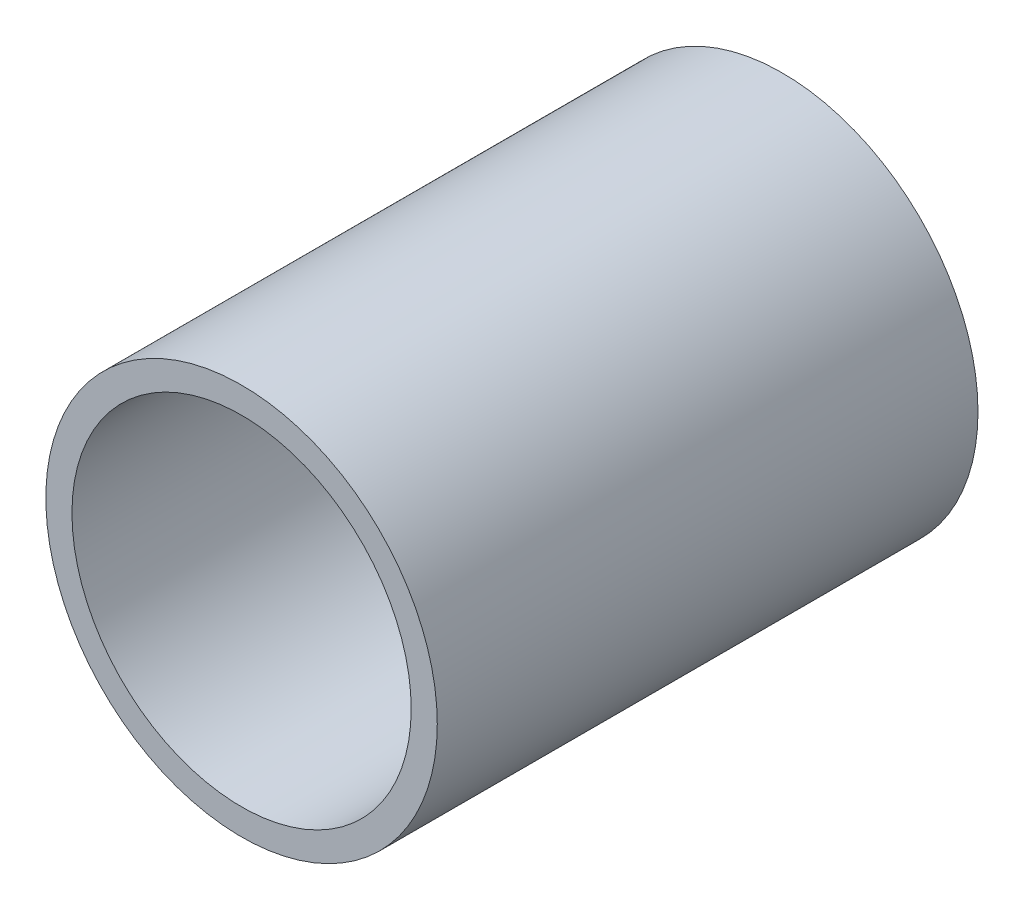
from build123d import *

# Parameters (mm, degrees)
SKETCH1_R          = 95.25
SKETCH1_R_2        = 82.55
BASE_EXTRUDE_DEPTH = 263.144


with BuildPart() as part:
    # Sketch1 → Base-Extrude (new body)
    with BuildSketch(Plane.XY):
        Circle(SKETCH1_R)
        Circle(SKETCH1_R_2, mode=Mode.SUBTRACT)
    extrude(amount=BASE_EXTRUDE_DEPTH)


solid = part.part
